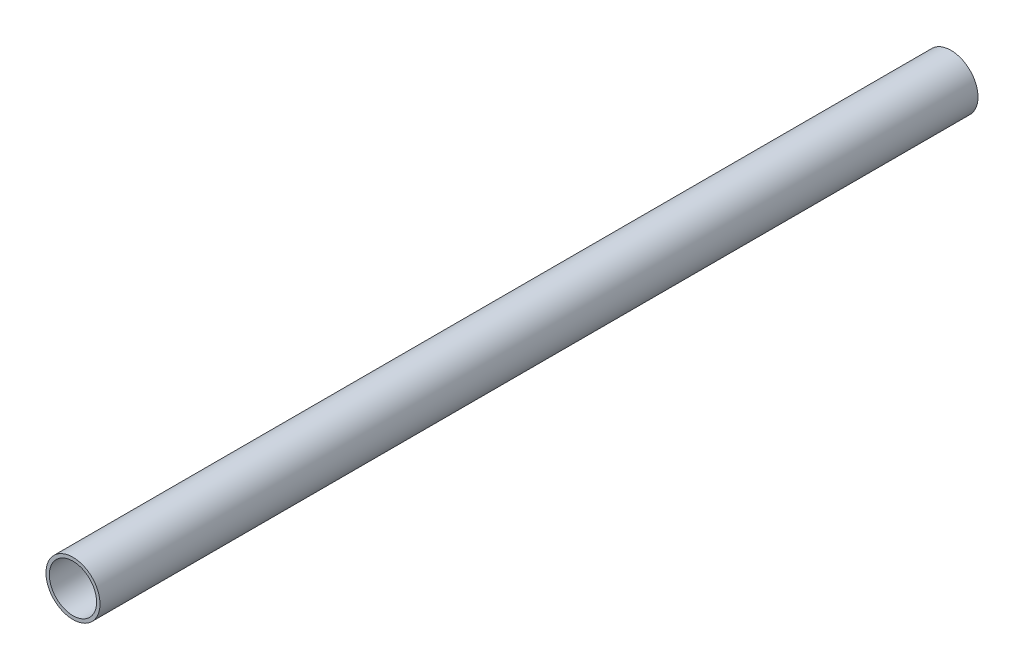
ISO-10303-21;
HEADER;
FILE_DESCRIPTION(('STEP AP214'),'2;1');
FILE_NAME('part.step','',(''),(''),'','','');
FILE_SCHEMA(('AUTOMOTIVE_DESIGN { 1 0 10303 214 1 1 1 1 }'));
ENDSEC;
DATA;
#1=APPLICATION_CONTEXT('core data for automotive mechanical design processes');
#2=APPLICATION_PROTOCOL_DEFINITION('international standard','automotive_design',2000,#1);
#3=PRODUCT_CONTEXT('',#1,'mechanical');
#4=PRODUCT('Part','Part','',(#3));
#5=PRODUCT_RELATED_PRODUCT_CATEGORY('part','',(#4));
#6=PRODUCT_DEFINITION_FORMATION('','',#4);
#7=PRODUCT_DEFINITION_CONTEXT('part definition',#1,'design');
#8=PRODUCT_DEFINITION('design','',#6,#7);
#9=PRODUCT_DEFINITION_SHAPE('','',#8);
#10=(LENGTH_UNIT() NAMED_UNIT(*) SI_UNIT(.MILLI.,.METRE.));
#11=(NAMED_UNIT(*) PLANE_ANGLE_UNIT() SI_UNIT($,.RADIAN.));
#12=(NAMED_UNIT(*) SI_UNIT($,.STERADIAN.) SOLID_ANGLE_UNIT());
#13=UNCERTAINTY_MEASURE_WITH_UNIT(LENGTH_MEASURE(1.E-05),#10,'distance_accuracy_value','');
#14=(GEOMETRIC_REPRESENTATION_CONTEXT(3) GLOBAL_UNCERTAINTY_ASSIGNED_CONTEXT((#13)) GLOBAL_UNIT_ASSIGNED_CONTEXT((#10,
#11,#12)) REPRESENTATION_CONTEXT('',''));
#15=CARTESIAN_POINT('',(0.,0.,0.));
#16=DIRECTION('',(0.,0.,1.));
#17=DIRECTION('',(1.,0.,0.));
#18=AXIS2_PLACEMENT_3D('',#15,#16,#17);
#19=CARTESIAN_POINT('',(0.,0.,39.));
#20=DIRECTION('',(0.,0.,1.));
#21=DIRECTION('',(1.,0.,0.));
#22=AXIS2_PLACEMENT_3D('',#19,#20,#21);
#23=PLANE('',#22);
#24=CARTESIAN_POINT('',(0.,0.,39.));
#25=DIRECTION('',(0.,0.,1.));
#26=DIRECTION('',(1.,0.,0.));
#27=AXIS2_PLACEMENT_3D('',#24,#25,#26);
#28=CIRCLE('',#27,1.2);
#29=CARTESIAN_POINT('',(1.2,0.,39.));
#30=VERTEX_POINT('',#29);
#31=EDGE_CURVE('E10',#30,#30,#28,.T.);
#32=ORIENTED_EDGE('',*,*,#31,.T.);
#33=EDGE_LOOP('',(#32));
#34=FACE_BOUND('',#33,.T.);
#35=CARTESIAN_POINT('',(0.,0.,39.));
#36=DIRECTION('',(0.,0.,1.));
#37=DIRECTION('',(1.,0.,0.));
#38=AXIS2_PLACEMENT_3D('',#35,#36,#37);
#39=CIRCLE('',#38,1.05);
#40=CARTESIAN_POINT('',(1.05,0.,39.));
#41=VERTEX_POINT('',#40);
#42=EDGE_CURVE('E39',#41,#41,#39,.T.);
#43=ORIENTED_EDGE('',*,*,#42,.F.);
#44=EDGE_LOOP('',(#43));
#45=FACE_BOUND('',#44,.T.);
#46=ADVANCED_FACE('F28',(#34,#45),#23,.T.);
#47=CARTESIAN_POINT('',(0.,0.,0.));
#48=DIRECTION('',(0.,0.,1.));
#49=DIRECTION('',(1.,0.,0.));
#50=AXIS2_PLACEMENT_3D('',#47,#48,#49);
#51=PLANE('',#50);
#52=CARTESIAN_POINT('',(0.,0.,0.));
#53=DIRECTION('',(0.,0.,1.));
#54=DIRECTION('',(1.,0.,0.));
#55=AXIS2_PLACEMENT_3D('',#52,#53,#54);
#56=CIRCLE('',#55,1.2);
#57=CARTESIAN_POINT('',(1.2,0.,0.));
#58=VERTEX_POINT('',#57);
#59=EDGE_CURVE('E32',#58,#58,#56,.T.);
#60=ORIENTED_EDGE('',*,*,#59,.F.);
#61=EDGE_LOOP('',(#60));
#62=FACE_BOUND('',#61,.T.);
#63=CARTESIAN_POINT('',(0.,0.,0.));
#64=DIRECTION('',(0.,0.,1.));
#65=DIRECTION('',(1.,0.,0.));
#66=AXIS2_PLACEMENT_3D('',#63,#64,#65);
#67=CIRCLE('',#66,1.05);
#68=CARTESIAN_POINT('',(1.05,0.,0.));
#69=VERTEX_POINT('',#68);
#70=EDGE_CURVE('E41',#69,#69,#67,.T.);
#71=ORIENTED_EDGE('',*,*,#70,.T.);
#72=EDGE_LOOP('',(#71));
#73=FACE_BOUND('',#72,.T.);
#74=ADVANCED_FACE('F51',(#62,#73),#51,.F.);
#75=CARTESIAN_POINT('',(0.,0.,39.));
#76=DIRECTION('',(0.,0.,-1.));
#77=DIRECTION('',(-1.,0.,0.));
#78=AXIS2_PLACEMENT_3D('',#75,#76,#77);
#79=CYLINDRICAL_SURFACE('',#78,1.2);
#80=ORIENTED_EDGE('',*,*,#31,.F.);
#81=EDGE_LOOP('',(#80));
#82=FACE_BOUND('',#81,.T.);
#83=ORIENTED_EDGE('',*,*,#59,.T.);
#84=EDGE_LOOP('',(#83));
#85=FACE_BOUND('',#84,.T.);
#86=ADVANCED_FACE('F30',(#82,#85),#79,.T.);
#87=CARTESIAN_POINT('',(0.,0.,39.));
#88=DIRECTION('',(0.,0.,-1.));
#89=DIRECTION('',(-1.,0.,0.));
#90=AXIS2_PLACEMENT_3D('',#87,#88,#89);
#91=CYLINDRICAL_SURFACE('',#90,1.05);
#92=ORIENTED_EDGE('',*,*,#42,.T.);
#93=EDGE_LOOP('',(#92));
#94=FACE_BOUND('',#93,.T.);
#95=ORIENTED_EDGE('',*,*,#70,.F.);
#96=EDGE_LOOP('',(#95));
#97=FACE_BOUND('',#96,.T.);
#98=ADVANCED_FACE('F47',(#94,#97),#91,.F.);
#99=CLOSED_SHELL('',(#46,#74,#86,#98));
#100=MANIFOLD_SOLID_BREP('B2',#99);
#101=ADVANCED_BREP_SHAPE_REPRESENTATION('',(#18,#100),#14);
#102=SHAPE_DEFINITION_REPRESENTATION(#9,#101);
ENDSEC;
END-ISO-10303-21;
